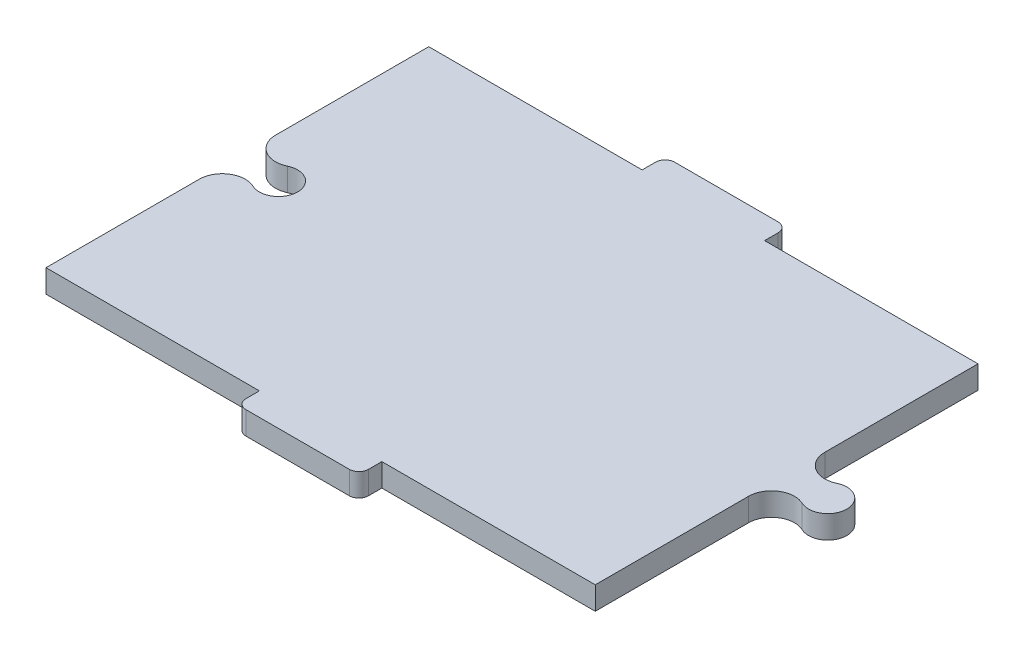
from build123d import *

# Parameters (mm, degrees)
BOSS_EXTRUDE1_DEPTH = 12


with BuildPart() as part:
    # Sketch1 → Boss-Extrude1 (new body)
    with BuildSketch(Plane(origin=(0, 0, 0), x_dir=(1, 0, 0), z_dir=(0, 1, 0))):
        with BuildLine():
            Line((-143.505, -100), (-32, -100))
            Line((-32, -100), (-32, -107))
            ThreePointArc((-32, -107), (-30.535533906, -110.535533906), (-27, -112))
            Line((-27, -112), (27, -112))
            ThreePointArc((27, -112), (30.535533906, -110.535533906), (32, -107))
            Line((32, -107), (32, -100))
            Line((32, -100), (143.505, -100))
            Line((143.505, -100), (143.505, -19.933392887))
            ThreePointArc((143.505, -19.933392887), (149.108555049, -9.752439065), (160.707860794, -9.039868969))
            ThreePointArc((160.707860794, -9.039868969), (174.983462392, 0), (160.707860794, 9.039868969))
            ThreePointArc((160.707860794, 9.039868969), (149.108555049, 9.752439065), (143.505, 19.933392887))
            Line((143.505, 19.933392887), (143.505, 100))
            Line((143.505, 100), (32, 100))
            Line((32, 100), (32, 107))
            ThreePointArc((32, 107), (30.535533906, 110.535533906), (27, 112))
            Line((27, 112), (-27, 112))
            ThreePointArc((-27, 112), (-30.535533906, 110.535533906), (-32, 107))
            Line((-32, 107), (-32, 100))
            Line((-32, 100), (-143.505, 100))
            Line((-143.505, 100), (-143.505, 19.935))
            ThreePointArc((-143.505, 19.935), (-137.902820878, 9.75521091), (-126.30531437, 9.040816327))
            ThreePointArc((-126.30531437, 9.040816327), (-112.031716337, 0), (-126.30531437, -9.040816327))
            ThreePointArc((-126.30531437, -9.040816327), (-137.902820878, -9.75521091), (-143.505, -19.935))
            Line((-143.505, -19.935), (-143.505, -100))
        make_face()
    extrude(amount=BOSS_EXTRUDE1_DEPTH)


solid = part.part
